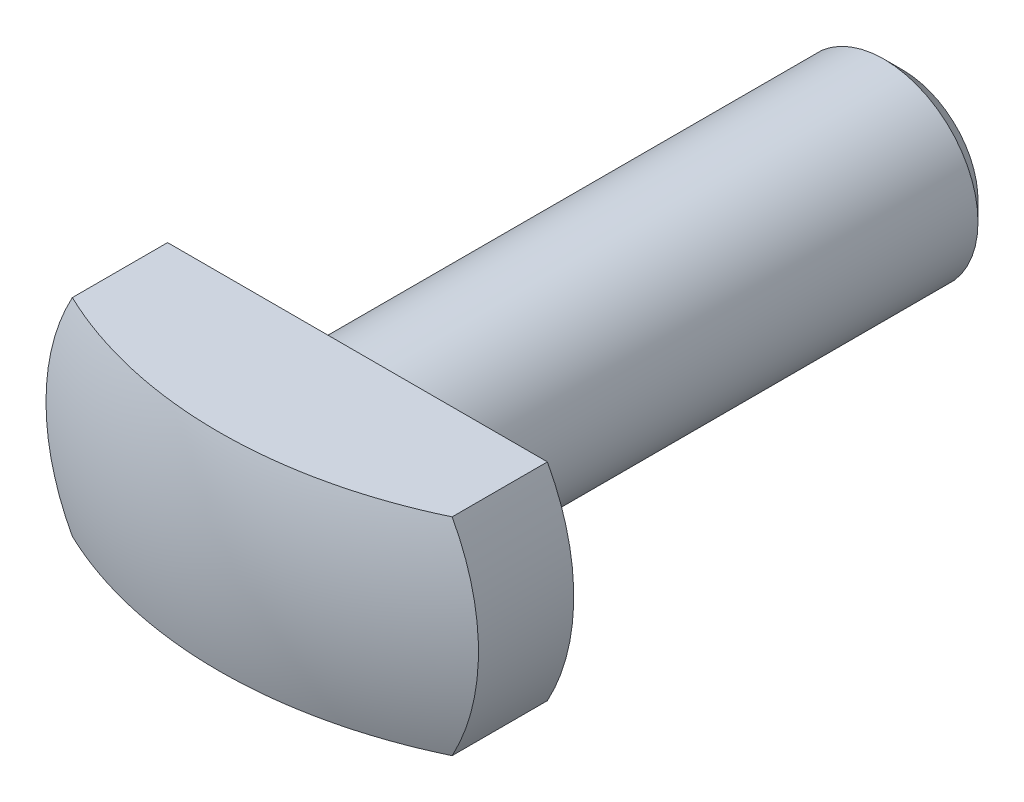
ISO-10303-21;
HEADER;
FILE_DESCRIPTION(('STEP AP214'),'2;1');
FILE_NAME('part.step','',(''),(''),'','','');
FILE_SCHEMA(('AUTOMOTIVE_DESIGN { 1 0 10303 214 1 1 1 1 }'));
ENDSEC;
DATA;
#1=APPLICATION_CONTEXT('core data for automotive mechanical design processes');
#2=APPLICATION_PROTOCOL_DEFINITION('international standard','automotive_design',2000,#1);
#3=PRODUCT_CONTEXT('',#1,'mechanical');
#4=PRODUCT('Part','Part','',(#3));
#5=PRODUCT_RELATED_PRODUCT_CATEGORY('part','',(#4));
#6=PRODUCT_DEFINITION_FORMATION('','',#4);
#7=PRODUCT_DEFINITION_CONTEXT('part definition',#1,'design');
#8=PRODUCT_DEFINITION('design','',#6,#7);
#9=PRODUCT_DEFINITION_SHAPE('','',#8);
#10=(LENGTH_UNIT() NAMED_UNIT(*) SI_UNIT(.MILLI.,.METRE.));
#11=(NAMED_UNIT(*) PLANE_ANGLE_UNIT() SI_UNIT($,.RADIAN.));
#12=(NAMED_UNIT(*) SI_UNIT($,.STERADIAN.) SOLID_ANGLE_UNIT());
#13=UNCERTAINTY_MEASURE_WITH_UNIT(LENGTH_MEASURE(1.E-05),#10,'distance_accuracy_value','');
#14=(GEOMETRIC_REPRESENTATION_CONTEXT(3) GLOBAL_UNCERTAINTY_ASSIGNED_CONTEXT((#13)) GLOBAL_UNIT_ASSIGNED_CONTEXT((#10,
#11,#12)) REPRESENTATION_CONTEXT('',''));
#15=CARTESIAN_POINT('',(0.,0.,0.));
#16=DIRECTION('',(0.,0.,1.));
#17=DIRECTION('',(1.,0.,0.));
#18=AXIS2_PLACEMENT_3D('',#15,#16,#17);
#19=CARTESIAN_POINT('',(0.,0.,4.));
#20=DIRECTION('',(0.,0.,1.));
#21=DIRECTION('',(0.,-1.,0.));
#22=AXIS2_PLACEMENT_3D('',#19,#20,#21);
#23=CYLINDRICAL_SURFACE('',#22,5.75);
#24=DIRECTION('',(0.,0.,1.));
#25=VECTOR('',#24,1.);
#26=CARTESIAN_POINT('',(5.04975246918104,2.75,4.));
#27=LINE('',#26,#25);
#28=CARTESIAN_POINT('',(5.04975246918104,2.75,2.53268721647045));
#29=VERTEX_POINT('',#28);
#30=CARTESIAN_POINT('',(5.04975246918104,2.75,0.));
#31=VERTEX_POINT('',#30);
#32=EDGE_CURVE('E28',#29,#31,#27,.F.);
#33=ORIENTED_EDGE('',*,*,#32,.F.);
#34=CARTESIAN_POINT('',(0.,0.,2.53268721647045));
#35=DIRECTION('',(0.,0.,1.));
#36=DIRECTION('',(0.,-1.,0.));
#37=AXIS2_PLACEMENT_3D('',#34,#35,#36);
#38=CIRCLE('',#37,5.75);
#39=CARTESIAN_POINT('',(5.04975246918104,-2.75,2.53268721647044));
#40=VERTEX_POINT('',#39);
#41=EDGE_CURVE('E75',#40,#29,#38,.T.);
#42=ORIENTED_EDGE('',*,*,#41,.F.);
#43=DIRECTION('',(0.,0.,1.));
#44=VECTOR('',#43,1.);
#45=CARTESIAN_POINT('',(5.04975246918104,-2.75,4.));
#46=LINE('',#45,#44);
#47=CARTESIAN_POINT('',(5.04975246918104,-2.75,0.));
#48=VERTEX_POINT('',#47);
#49=EDGE_CURVE('E87',#48,#40,#46,.T.);
#50=ORIENTED_EDGE('',*,*,#49,.F.);
#51=CARTESIAN_POINT('',(0.,0.,0.));
#52=DIRECTION('',(0.,0.,1.));
#53=DIRECTION('',(0.,-1.,0.));
#54=AXIS2_PLACEMENT_3D('',#51,#52,#53);
#55=CIRCLE('',#54,5.75);
#56=EDGE_CURVE('E67',#48,#31,#55,.T.);
#57=ORIENTED_EDGE('',*,*,#56,.T.);
#58=EDGE_LOOP('',(#33,#42,#50,#57));
#59=FACE_BOUND('',#58,.T.);
#60=ADVANCED_FACE('F14',(#59),#23,.T.);
#61=CARTESIAN_POINT('',(0.,0.,-8.));
#62=DIRECTION('',(0.,0.,1.));
#63=DIRECTION('',(-1.,0.,0.));
#64=AXIS2_PLACEMENT_3D('',#61,#62,#63);
#65=SPHERICAL_SURFACE('',#64,12.);
#66=CARTESIAN_POINT('',(0.,2.75,-8.));
#67=DIRECTION('',(0.,-1.,0.));
#68=DIRECTION('',(-1.,0.,0.));
#69=AXIS2_PLACEMENT_3D('',#66,#67,#68);
#70=CIRCLE('',#69,11.6806463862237);
#71=CARTESIAN_POINT('',(-5.04975246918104,2.75,2.53268721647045));
#72=VERTEX_POINT('',#71);
#73=EDGE_CURVE('E62',#72,#29,#70,.F.);
#74=ORIENTED_EDGE('',*,*,#73,.F.);
#75=CARTESIAN_POINT('',(-5.04975246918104,-2.75,2.53268721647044));
#76=VERTEX_POINT('',#75);
#77=EDGE_CURVE('E61',#72,#76,#38,.T.);
#78=ORIENTED_EDGE('',*,*,#77,.T.);
#79=CARTESIAN_POINT('',(0.,-2.75,-8.));
#80=DIRECTION('',(0.,1.,0.));
#81=DIRECTION('',(1.,0.,0.));
#82=AXIS2_PLACEMENT_3D('',#79,#80,#81);
#83=CIRCLE('',#82,11.6806463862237);
#84=EDGE_CURVE('E91',#40,#76,#83,.F.);
#85=ORIENTED_EDGE('',*,*,#84,.F.);
#86=ORIENTED_EDGE('',*,*,#41,.T.);
#87=EDGE_LOOP('',(#74,#78,#85,#86));
#88=FACE_BOUND('',#87,.T.);
#89=ADVANCED_FACE('F16',(#88),#65,.T.);
#90=DIRECTION('',(0.,0.,1.));
#91=VECTOR('',#90,1.);
#92=CARTESIAN_POINT('',(-5.04975246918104,2.75,4.));
#93=LINE('',#92,#91);
#94=CARTESIAN_POINT('',(-5.04975246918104,2.75,0.));
#95=VERTEX_POINT('',#94);
#96=EDGE_CURVE('E54',#95,#72,#93,.T.);
#97=ORIENTED_EDGE('',*,*,#96,.F.);
#98=CARTESIAN_POINT('',(-5.04975246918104,-2.75,0.));
#99=VERTEX_POINT('',#98);
#100=EDGE_CURVE('E36',#95,#99,#55,.T.);
#101=ORIENTED_EDGE('',*,*,#100,.T.);
#102=DIRECTION('',(0.,0.,1.));
#103=VECTOR('',#102,1.);
#104=CARTESIAN_POINT('',(-5.04975246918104,-2.75,4.));
#105=LINE('',#104,#103);
#106=EDGE_CURVE('E71',#76,#99,#105,.F.);
#107=ORIENTED_EDGE('',*,*,#106,.F.);
#108=ORIENTED_EDGE('',*,*,#77,.F.);
#109=EDGE_LOOP('',(#97,#101,#107,#108));
#110=FACE_BOUND('',#109,.T.);
#111=ADVANCED_FACE('F60',(#110),#23,.T.);
#112=CARTESIAN_POINT('',(2.5,0.,0.));
#113=DIRECTION('',(0.,0.,-1.));
#114=DIRECTION('',(0.,1.,0.));
#115=AXIS2_PLACEMENT_3D('',#112,#113,#114);
#116=PLANE('',#115);
#117=DIRECTION('',(-1.,0.,0.));
#118=VECTOR('',#117,1.);
#119=CARTESIAN_POINT('',(2.5,2.75,0.));
#120=LINE('',#119,#118);
#121=EDGE_CURVE('E9',#31,#95,#120,.T.);
#122=ORIENTED_EDGE('',*,*,#121,.F.);
#123=ORIENTED_EDGE('',*,*,#56,.F.);
#124=DIRECTION('',(1.,0.,0.));
#125=VECTOR('',#124,1.);
#126=CARTESIAN_POINT('',(2.5,-2.75,0.));
#127=LINE('',#126,#125);
#128=EDGE_CURVE('E22',#99,#48,#127,.T.);
#129=ORIENTED_EDGE('',*,*,#128,.F.);
#130=ORIENTED_EDGE('',*,*,#100,.F.);
#131=EDGE_LOOP('',(#122,#123,#129,#130));
#132=FACE_BOUND('',#131,.T.);
#133=CARTESIAN_POINT('',(0.,0.,0.));
#134=DIRECTION('',(0.,0.,1.));
#135=DIRECTION('',(0.,-1.,0.));
#136=AXIS2_PLACEMENT_3D('',#133,#134,#135);
#137=CIRCLE('',#136,2.5);
#138=CARTESIAN_POINT('',(0.,-2.5,0.));
#139=VERTEX_POINT('',#138);
#140=EDGE_CURVE('E68',#139,#139,#137,.T.);
#141=ORIENTED_EDGE('',*,*,#140,.T.);
#142=EDGE_LOOP('',(#141));
#143=FACE_BOUND('',#142,.T.);
#144=ADVANCED_FACE('F65',(#132,#143),#116,.T.);
#145=CARTESIAN_POINT('',(0.,0.,4.));
#146=DIRECTION('',(0.,0.,1.));
#147=DIRECTION('',(0.,-1.,0.));
#148=AXIS2_PLACEMENT_3D('',#145,#146,#147);
#149=CYLINDRICAL_SURFACE('',#148,2.5);
#150=CARTESIAN_POINT('',(0.,0.,-14.));
#151=DIRECTION('',(0.,0.,-1.));
#152=DIRECTION('',(0.,1.,0.));
#153=AXIS2_PLACEMENT_3D('',#150,#151,#152);
#154=CIRCLE('',#153,2.5);
#155=CARTESIAN_POINT('',(0.,2.5,-14.));
#156=VERTEX_POINT('',#155);
#157=EDGE_CURVE('E78',#156,#156,#154,.F.);
#158=ORIENTED_EDGE('',*,*,#157,.T.);
#159=EDGE_LOOP('',(#158));
#160=FACE_BOUND('',#159,.T.);
#161=ORIENTED_EDGE('',*,*,#140,.F.);
#162=EDGE_LOOP('',(#161));
#163=FACE_BOUND('',#162,.T.);
#164=ADVANCED_FACE('F110',(#160,#163),#149,.T.);
#165=CARTESIAN_POINT('',(0.,0.,-14.5));
#166=DIRECTION('',(0.,0.,-1.));
#167=DIRECTION('',(0.,1.,0.));
#168=AXIS2_PLACEMENT_3D('',#165,#166,#167);
#169=PLANE('',#168);
#170=CARTESIAN_POINT('',(0.,0.,-14.5));
#171=DIRECTION('',(0.,0.,-1.));
#172=DIRECTION('',(0.,1.,0.));
#173=AXIS2_PLACEMENT_3D('',#170,#171,#172);
#174=CIRCLE('',#173,2.);
#175=CARTESIAN_POINT('',(0.,2.,-14.5));
#176=VERTEX_POINT('',#175);
#177=EDGE_CURVE('E81',#176,#176,#174,.T.);
#178=ORIENTED_EDGE('',*,*,#177,.T.);
#179=EDGE_LOOP('',(#178));
#180=FACE_BOUND('',#179,.T.);
#181=ADVANCED_FACE('F113',(#180),#169,.T.);
#182=CARTESIAN_POINT('',(0.,0.,-14.));
#183=DIRECTION('',(0.,0.,1.));
#184=DIRECTION('',(0.,-1.,0.));
#185=AXIS2_PLACEMENT_3D('',#182,#183,#184);
#186=CONICAL_SURFACE('',#185,2.5,0.785398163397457);
#187=ORIENTED_EDGE('',*,*,#177,.F.);
#188=EDGE_LOOP('',(#187));
#189=FACE_BOUND('',#188,.T.);
#190=ORIENTED_EDGE('',*,*,#157,.F.);
#191=EDGE_LOOP('',(#190));
#192=FACE_BOUND('',#191,.T.);
#193=ADVANCED_FACE('F117',(#189,#192),#186,.T.);
#194=CARTESIAN_POINT('',(6.11250263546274,-2.75,4.));
#195=DIRECTION('',(0.,1.,0.));
#196=DIRECTION('',(1.,0.,0.));
#197=AXIS2_PLACEMENT_3D('',#194,#195,#196);
#198=PLANE('',#197);
#199=ORIENTED_EDGE('',*,*,#106,.T.);
#200=ORIENTED_EDGE('',*,*,#128,.T.);
#201=ORIENTED_EDGE('',*,*,#49,.T.);
#202=ORIENTED_EDGE('',*,*,#84,.T.);
#203=EDGE_LOOP('',(#199,#200,#201,#202));
#204=FACE_BOUND('',#203,.T.);
#205=ADVANCED_FACE('F85',(#204),#198,.F.);
#206=CARTESIAN_POINT('',(6.11250263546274,2.75,4.));
#207=DIRECTION('',(0.,-1.,0.));
#208=DIRECTION('',(-1.,0.,0.));
#209=AXIS2_PLACEMENT_3D('',#206,#207,#208);
#210=PLANE('',#209);
#211=ORIENTED_EDGE('',*,*,#32,.T.);
#212=ORIENTED_EDGE('',*,*,#121,.T.);
#213=ORIENTED_EDGE('',*,*,#96,.T.);
#214=ORIENTED_EDGE('',*,*,#73,.T.);
#215=EDGE_LOOP('',(#211,#212,#213,#214));
#216=FACE_BOUND('',#215,.T.);
#217=ADVANCED_FACE('F53',(#216),#210,.F.);
#218=CLOSED_SHELL('',(#60,#89,#111,#144,#164,#181,#193,#205,#217));
#219=MANIFOLD_SOLID_BREP('B1',#218);
#220=ADVANCED_BREP_SHAPE_REPRESENTATION('',(#18,#219),#14);
#221=SHAPE_DEFINITION_REPRESENTATION(#9,#220);
ENDSEC;
END-ISO-10303-21;
